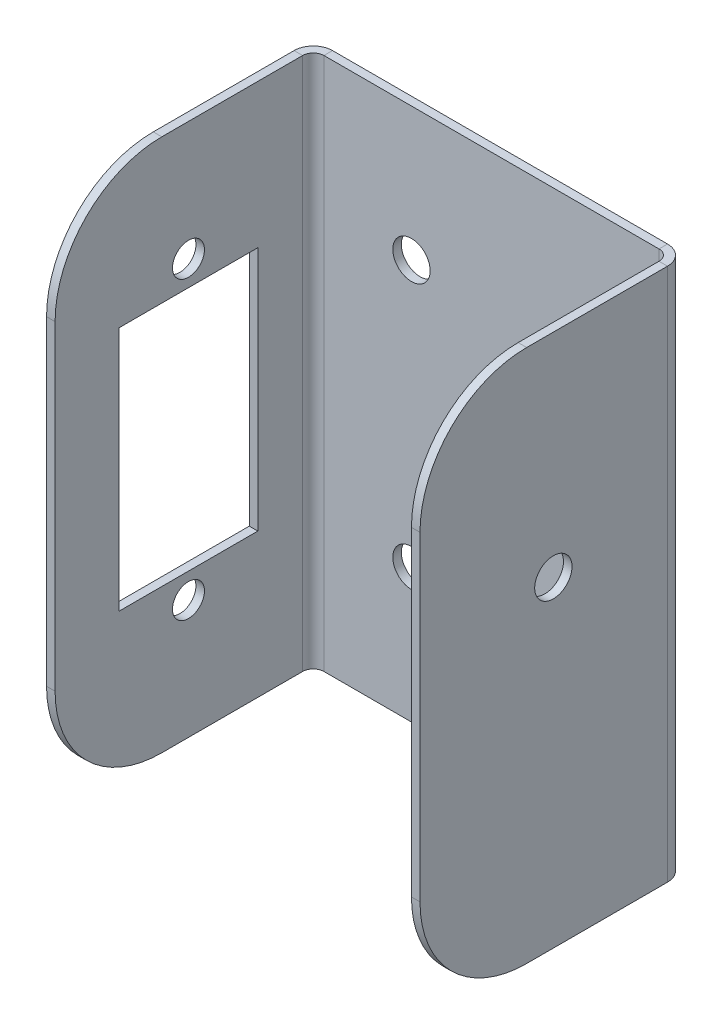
ISO-10303-21;
HEADER;
FILE_DESCRIPTION(('STEP AP214'),'2;1');
FILE_NAME('part.step','',(''),(''),'','','');
FILE_SCHEMA(('AUTOMOTIVE_DESIGN { 1 0 10303 214 1 1 1 1 }'));
ENDSEC;
DATA;
#1=APPLICATION_CONTEXT('core data for automotive mechanical design processes');
#2=APPLICATION_PROTOCOL_DEFINITION('international standard','automotive_design',2000,#1);
#3=PRODUCT_CONTEXT('',#1,'mechanical');
#4=PRODUCT('Part','Part','',(#3));
#5=PRODUCT_RELATED_PRODUCT_CATEGORY('part','',(#4));
#6=PRODUCT_DEFINITION_FORMATION('','',#4);
#7=PRODUCT_DEFINITION_CONTEXT('part definition',#1,'design');
#8=PRODUCT_DEFINITION('design','',#6,#7);
#9=PRODUCT_DEFINITION_SHAPE('','',#8);
#10=(LENGTH_UNIT() NAMED_UNIT(*) SI_UNIT(.MILLI.,.METRE.));
#11=(NAMED_UNIT(*) PLANE_ANGLE_UNIT() SI_UNIT($,.RADIAN.));
#12=(NAMED_UNIT(*) SI_UNIT($,.STERADIAN.) SOLID_ANGLE_UNIT());
#13=UNCERTAINTY_MEASURE_WITH_UNIT(LENGTH_MEASURE(1.E-05),#10,'distance_accuracy_value','');
#14=(GEOMETRIC_REPRESENTATION_CONTEXT(3) GLOBAL_UNCERTAINTY_ASSIGNED_CONTEXT((#13)) GLOBAL_UNIT_ASSIGNED_CONTEXT((#10,
#11,#12)) REPRESENTATION_CONTEXT('',''));
#15=CARTESIAN_POINT('',(0.,0.,0.));
#16=DIRECTION('',(0.,0.,1.));
#17=DIRECTION('',(1.,0.,0.));
#18=AXIS2_PLACEMENT_3D('',#15,#16,#17);
#19=CARTESIAN_POINT('',(-17.5,25.,0.8));
#20=DIRECTION('',(0.,-1.,0.));
#21=DIRECTION('',(0.,0.,-1.));
#22=AXIS2_PLACEMENT_3D('',#19,#20,#21);
#23=PLANE('',#22);
#24=DIRECTION('',(0.,0.,-1.));
#25=VECTOR('',#24,1.);
#26=CARTESIAN_POINT('',(15.7,25.,0.799999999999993));
#27=LINE('',#26,#25);
#28=CARTESIAN_POINT('',(15.7,25.,0.8));
#29=VERTEX_POINT('',#28);
#30=CARTESIAN_POINT('',(15.7,25.,0.));
#31=VERTEX_POINT('',#30);
#32=EDGE_CURVE('E301',#29,#31,#27,.T.);
#33=ORIENTED_EDGE('',*,*,#32,.T.);
#34=DIRECTION('',(-1.,0.,0.));
#35=VECTOR('',#34,1.);
#36=CARTESIAN_POINT('',(-17.5,25.,0.));
#37=LINE('',#36,#35);
#38=CARTESIAN_POINT('',(-15.7,25.,0.));
#39=VERTEX_POINT('',#38);
#40=EDGE_CURVE('E362',#31,#39,#37,.T.);
#41=ORIENTED_EDGE('',*,*,#40,.T.);
#42=DIRECTION('',(0.,0.,-1.));
#43=VECTOR('',#42,1.);
#44=CARTESIAN_POINT('',(-15.7,25.,0.799999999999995));
#45=LINE('',#44,#43);
#46=CARTESIAN_POINT('',(-15.7,25.,0.8));
#47=VERTEX_POINT('',#46);
#48=EDGE_CURVE('E359',#47,#39,#45,.T.);
#49=ORIENTED_EDGE('',*,*,#48,.F.);
#50=DIRECTION('',(-1.,0.,0.));
#51=VECTOR('',#50,1.);
#52=CARTESIAN_POINT('',(-17.5,25.,0.8));
#53=LINE('',#52,#51);
#54=EDGE_CURVE('E364',#29,#47,#53,.T.);
#55=ORIENTED_EDGE('',*,*,#54,.F.);
#56=EDGE_LOOP('',(#33,#41,#49,#55));
#57=FACE_BOUND('',#56,.T.);
#58=ADVANCED_FACE('F80',(#57),#23,.F.);
#59=CARTESIAN_POINT('',(-17.5,-25.,0.8));
#60=DIRECTION('',(0.,1.,0.));
#61=DIRECTION('',(0.,0.,1.));
#62=AXIS2_PLACEMENT_3D('',#59,#60,#61);
#63=PLANE('',#62);
#64=DIRECTION('',(0.,0.,-1.));
#65=VECTOR('',#64,1.);
#66=CARTESIAN_POINT('',(15.7,-25.,0.799999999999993));
#67=LINE('',#66,#65);
#68=CARTESIAN_POINT('',(15.7,-25.,0.8));
#69=VERTEX_POINT('',#68);
#70=CARTESIAN_POINT('',(15.7,-25.,0.));
#71=VERTEX_POINT('',#70);
#72=EDGE_CURVE('E312',#69,#71,#67,.T.);
#73=ORIENTED_EDGE('',*,*,#72,.F.);
#74=DIRECTION('',(1.,0.,0.));
#75=VECTOR('',#74,1.);
#76=CARTESIAN_POINT('',(-17.5,-25.,0.8));
#77=LINE('',#76,#75);
#78=CARTESIAN_POINT('',(-15.7,-25.,0.8));
#79=VERTEX_POINT('',#78);
#80=EDGE_CURVE('E366',#79,#69,#77,.T.);
#81=ORIENTED_EDGE('',*,*,#80,.F.);
#82=DIRECTION('',(0.,0.,-1.));
#83=VECTOR('',#82,1.);
#84=CARTESIAN_POINT('',(-15.7,-25.,0.799999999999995));
#85=LINE('',#84,#83);
#86=CARTESIAN_POINT('',(-15.7,-25.,0.));
#87=VERTEX_POINT('',#86);
#88=EDGE_CURVE('E348',#79,#87,#85,.T.);
#89=ORIENTED_EDGE('',*,*,#88,.T.);
#90=DIRECTION('',(1.,0.,0.));
#91=VECTOR('',#90,1.);
#92=CARTESIAN_POINT('',(-17.5,-25.,0.));
#93=LINE('',#92,#91);
#94=EDGE_CURVE('E367',#87,#71,#93,.T.);
#95=ORIENTED_EDGE('',*,*,#94,.T.);
#96=EDGE_LOOP('',(#73,#81,#89,#95));
#97=FACE_BOUND('',#96,.T.);
#98=ADVANCED_FACE('F440',(#97),#63,.F.);
#99=CARTESIAN_POINT('',(0.,0.,0.8));
#100=DIRECTION('',(0.,0.,1.));
#101=DIRECTION('',(1.,0.,0.));
#102=AXIS2_PLACEMENT_3D('',#99,#100,#101);
#103=PLANE('',#102);
#104=CARTESIAN_POINT('',(7.5,12.5,0.8));
#105=DIRECTION('',(0.,0.,-1.));
#106=DIRECTION('',(-1.,0.,0.));
#107=AXIS2_PLACEMENT_3D('',#104,#105,#106);
#108=CIRCLE('',#107,1.75);
#109=CARTESIAN_POINT('',(5.75,12.5,0.8));
#110=VERTEX_POINT('',#109);
#111=EDGE_CURVE('E892',#110,#110,#108,.T.);
#112=ORIENTED_EDGE('',*,*,#111,.T.);
#113=EDGE_LOOP('',(#112));
#114=FACE_BOUND('',#113,.T.);
#115=CARTESIAN_POINT('',(-7.5,-12.5,0.8));
#116=DIRECTION('',(0.,0.,-1.));
#117=DIRECTION('',(-1.,0.,0.));
#118=AXIS2_PLACEMENT_3D('',#115,#116,#117);
#119=CIRCLE('',#118,1.75);
#120=CARTESIAN_POINT('',(-9.25,-12.5,0.8));
#121=VERTEX_POINT('',#120);
#122=EDGE_CURVE('E913',#121,#121,#119,.T.);
#123=ORIENTED_EDGE('',*,*,#122,.T.);
#124=EDGE_LOOP('',(#123));
#125=FACE_BOUND('',#124,.T.);
#126=CARTESIAN_POINT('',(7.5,-12.5,0.8));
#127=DIRECTION('',(0.,0.,-1.));
#128=DIRECTION('',(-1.,0.,0.));
#129=AXIS2_PLACEMENT_3D('',#126,#127,#128);
#130=CIRCLE('',#129,1.75);
#131=CARTESIAN_POINT('',(5.75,-12.5,0.8));
#132=VERTEX_POINT('',#131);
#133=EDGE_CURVE('E906',#132,#132,#130,.T.);
#134=ORIENTED_EDGE('',*,*,#133,.T.);
#135=EDGE_LOOP('',(#134));
#136=FACE_BOUND('',#135,.T.);
#137=CARTESIAN_POINT('',(-7.5,12.5,0.8));
#138=DIRECTION('',(0.,0.,-1.));
#139=DIRECTION('',(-1.,0.,0.));
#140=AXIS2_PLACEMENT_3D('',#137,#138,#139);
#141=CIRCLE('',#140,1.75);
#142=CARTESIAN_POINT('',(-9.25,12.5,0.8));
#143=VERTEX_POINT('',#142);
#144=EDGE_CURVE('E884',#143,#143,#141,.T.);
#145=ORIENTED_EDGE('',*,*,#144,.T.);
#146=EDGE_LOOP('',(#145));
#147=FACE_BOUND('',#146,.T.);
#148=ORIENTED_EDGE('',*,*,#80,.T.);
#149=DIRECTION('',(0.,1.,0.));
#150=VECTOR('',#149,1.);
#151=CARTESIAN_POINT('',(15.7,25.,0.799999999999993));
#152=LINE('',#151,#150);
#153=EDGE_CURVE('E307',#29,#69,#152,.F.);
#154=ORIENTED_EDGE('',*,*,#153,.F.);
#155=ORIENTED_EDGE('',*,*,#54,.T.);
#156=DIRECTION('',(0.,-1.,0.));
#157=VECTOR('',#156,1.);
#158=CARTESIAN_POINT('',(-15.7,-25.,0.799999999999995));
#159=LINE('',#158,#157);
#160=EDGE_CURVE('E354',#79,#47,#159,.F.);
#161=ORIENTED_EDGE('',*,*,#160,.F.);
#162=EDGE_LOOP('',(#148,#154,#155,#161));
#163=FACE_BOUND('',#162,.T.);
#164=ADVANCED_FACE('F444',(#114,#125,#136,#147,#163),#103,.T.);
#165=CARTESIAN_POINT('',(0.,0.,0.));
#166=DIRECTION('',(0.,0.,1.));
#167=DIRECTION('',(1.,0.,0.));
#168=AXIS2_PLACEMENT_3D('',#165,#166,#167);
#169=PLANE('',#168);
#170=CARTESIAN_POINT('',(7.5,12.5,0.));
#171=DIRECTION('',(0.,0.,-1.));
#172=DIRECTION('',(-1.,0.,0.));
#173=AXIS2_PLACEMENT_3D('',#170,#171,#172);
#174=CIRCLE('',#173,1.75);
#175=CARTESIAN_POINT('',(5.75,12.5,0.));
#176=VERTEX_POINT('',#175);
#177=EDGE_CURVE('E916',#176,#176,#174,.T.);
#178=ORIENTED_EDGE('',*,*,#177,.F.);
#179=EDGE_LOOP('',(#178));
#180=FACE_BOUND('',#179,.T.);
#181=CARTESIAN_POINT('',(-7.5,-12.5,0.));
#182=DIRECTION('',(0.,0.,-1.));
#183=DIRECTION('',(-1.,0.,0.));
#184=AXIS2_PLACEMENT_3D('',#181,#182,#183);
#185=CIRCLE('',#184,1.75);
#186=CARTESIAN_POINT('',(-9.25,-12.5,0.));
#187=VERTEX_POINT('',#186);
#188=EDGE_CURVE('E910',#187,#187,#185,.T.);
#189=ORIENTED_EDGE('',*,*,#188,.F.);
#190=EDGE_LOOP('',(#189));
#191=FACE_BOUND('',#190,.T.);
#192=CARTESIAN_POINT('',(7.5,-12.5,0.));
#193=DIRECTION('',(0.,0.,-1.));
#194=DIRECTION('',(-1.,0.,0.));
#195=AXIS2_PLACEMENT_3D('',#192,#193,#194);
#196=CIRCLE('',#195,1.75);
#197=CARTESIAN_POINT('',(5.75,-12.5,0.));
#198=VERTEX_POINT('',#197);
#199=EDGE_CURVE('E895',#198,#198,#196,.T.);
#200=ORIENTED_EDGE('',*,*,#199,.F.);
#201=EDGE_LOOP('',(#200));
#202=FACE_BOUND('',#201,.T.);
#203=CARTESIAN_POINT('',(-7.5,12.5,0.));
#204=DIRECTION('',(0.,0.,-1.));
#205=DIRECTION('',(-1.,0.,0.));
#206=AXIS2_PLACEMENT_3D('',#203,#204,#205);
#207=CIRCLE('',#206,1.75);
#208=CARTESIAN_POINT('',(-9.25,12.5,0.));
#209=VERTEX_POINT('',#208);
#210=EDGE_CURVE('E887',#209,#209,#207,.T.);
#211=ORIENTED_EDGE('',*,*,#210,.F.);
#212=EDGE_LOOP('',(#211));
#213=FACE_BOUND('',#212,.T.);
#214=DIRECTION('',(0.,1.,0.));
#215=VECTOR('',#214,1.);
#216=CARTESIAN_POINT('',(15.7,25.,0.));
#217=LINE('',#216,#215);
#218=EDGE_CURVE('E295',#31,#71,#217,.F.);
#219=ORIENTED_EDGE('',*,*,#218,.T.);
#220=ORIENTED_EDGE('',*,*,#94,.F.);
#221=DIRECTION('',(0.,-1.,0.));
#222=VECTOR('',#221,1.);
#223=CARTESIAN_POINT('',(-15.7,-25.,0.));
#224=LINE('',#223,#222);
#225=EDGE_CURVE('E341',#87,#39,#224,.F.);
#226=ORIENTED_EDGE('',*,*,#225,.T.);
#227=ORIENTED_EDGE('',*,*,#40,.F.);
#228=EDGE_LOOP('',(#219,#220,#226,#227));
#229=FACE_BOUND('',#228,.T.);
#230=ADVANCED_FACE('F456',(#180,#191,#202,#213,#229),#169,.F.);
#231=CARTESIAN_POINT('',(-15.7,25.,1.8));
#232=DIRECTION('',(0.,1.,0.));
#233=DIRECTION('',(0.,0.,1.));
#234=AXIS2_PLACEMENT_3D('',#231,#232,#233);
#235=PLANE('',#234);
#236=DIRECTION('',(1.,0.,0.));
#237=VECTOR('',#236,1.);
#238=CARTESIAN_POINT('',(-17.5,25.,1.79999999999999));
#239=LINE('',#238,#237);
#240=CARTESIAN_POINT('',(-16.7,25.,1.8));
#241=VERTEX_POINT('',#240);
#242=CARTESIAN_POINT('',(-17.5,25.,1.79999999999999));
#243=VERTEX_POINT('',#242);
#244=EDGE_CURVE('E315',#241,#243,#239,.F.);
#245=ORIENTED_EDGE('',*,*,#244,.F.);
#246=CARTESIAN_POINT('',(-15.7,25.,1.8));
#247=DIRECTION('',(0.,-1.,0.));
#248=DIRECTION('',(0.,0.,-1.));
#249=AXIS2_PLACEMENT_3D('',#246,#247,#248);
#250=CIRCLE('',#249,1.);
#251=EDGE_CURVE('E351',#47,#241,#250,.F.);
#252=ORIENTED_EDGE('',*,*,#251,.F.);
#253=ORIENTED_EDGE('',*,*,#48,.T.);
#254=CARTESIAN_POINT('',(-15.7,25.,1.8));
#255=DIRECTION('',(0.,-1.,0.));
#256=DIRECTION('',(0.,0.,-1.));
#257=AXIS2_PLACEMENT_3D('',#254,#255,#256);
#258=CIRCLE('',#257,1.8);
#259=EDGE_CURVE('E344',#39,#243,#258,.F.);
#260=ORIENTED_EDGE('',*,*,#259,.T.);
#261=EDGE_LOOP('',(#245,#252,#253,#260));
#262=FACE_BOUND('',#261,.T.);
#263=ADVANCED_FACE('F463',(#262),#235,.T.);
#264=CARTESIAN_POINT('',(-15.7,-25.,1.8));
#265=DIRECTION('',(0.,1.,0.));
#266=DIRECTION('',(0.,0.,1.));
#267=AXIS2_PLACEMENT_3D('',#264,#265,#266);
#268=PLANE('',#267);
#269=CARTESIAN_POINT('',(-15.7,-25.,1.8));
#270=DIRECTION('',(0.,-1.,0.));
#271=DIRECTION('',(0.,0.,-1.));
#272=AXIS2_PLACEMENT_3D('',#269,#270,#271);
#273=CIRCLE('',#272,1.);
#274=CARTESIAN_POINT('',(-16.7,-25.,1.8));
#275=VERTEX_POINT('',#274);
#276=EDGE_CURVE('E319',#275,#79,#273,.T.);
#277=ORIENTED_EDGE('',*,*,#276,.F.);
#278=DIRECTION('',(1.,0.,0.));
#279=VECTOR('',#278,1.);
#280=CARTESIAN_POINT('',(-16.7,-25.,1.8));
#281=LINE('',#280,#279);
#282=CARTESIAN_POINT('',(-17.5,-25.,1.79999999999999));
#283=VERTEX_POINT('',#282);
#284=EDGE_CURVE('E334',#275,#283,#281,.F.);
#285=ORIENTED_EDGE('',*,*,#284,.T.);
#286=CARTESIAN_POINT('',(-15.7,-25.,1.8));
#287=DIRECTION('',(0.,-1.,0.));
#288=DIRECTION('',(0.,0.,-1.));
#289=AXIS2_PLACEMENT_3D('',#286,#287,#288);
#290=CIRCLE('',#289,1.8);
#291=EDGE_CURVE('E345',#283,#87,#290,.T.);
#292=ORIENTED_EDGE('',*,*,#291,.T.);
#293=ORIENTED_EDGE('',*,*,#88,.F.);
#294=EDGE_LOOP('',(#277,#285,#292,#293));
#295=FACE_BOUND('',#294,.T.);
#296=ADVANCED_FACE('F489',(#295),#268,.F.);
#297=CARTESIAN_POINT('',(-15.7,-25.,1.8));
#298=DIRECTION('',(0.,-1.,0.));
#299=DIRECTION('',(-1.,0.,0.));
#300=AXIS2_PLACEMENT_3D('',#297,#298,#299);
#301=CYLINDRICAL_SURFACE('',#300,1.8);
#302=ORIENTED_EDGE('',*,*,#225,.F.);
#303=ORIENTED_EDGE('',*,*,#291,.F.);
#304=DIRECTION('',(0.,-1.,0.));
#305=VECTOR('',#304,1.);
#306=CARTESIAN_POINT('',(-17.5,25.,1.79999999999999));
#307=LINE('',#306,#305);
#308=EDGE_CURVE('E331',#283,#243,#307,.F.);
#309=ORIENTED_EDGE('',*,*,#308,.T.);
#310=ORIENTED_EDGE('',*,*,#259,.F.);
#311=EDGE_LOOP('',(#302,#303,#309,#310));
#312=FACE_BOUND('',#311,.T.);
#313=ADVANCED_FACE('F464',(#312),#301,.T.);
#314=CARTESIAN_POINT('',(-15.7,-25.,1.8));
#315=DIRECTION('',(0.,-1.,0.));
#316=DIRECTION('',(-1.,0.,0.));
#317=AXIS2_PLACEMENT_3D('',#314,#315,#316);
#318=CYLINDRICAL_SURFACE('',#317,1.);
#319=ORIENTED_EDGE('',*,*,#160,.T.);
#320=ORIENTED_EDGE('',*,*,#251,.T.);
#321=DIRECTION('',(0.,-1.,0.));
#322=VECTOR('',#321,1.);
#323=CARTESIAN_POINT('',(-16.7,25.,1.8));
#324=LINE('',#323,#322);
#325=EDGE_CURVE('E337',#241,#275,#324,.T.);
#326=ORIENTED_EDGE('',*,*,#325,.T.);
#327=ORIENTED_EDGE('',*,*,#276,.T.);
#328=EDGE_LOOP('',(#319,#320,#326,#327));
#329=FACE_BOUND('',#328,.T.);
#330=ADVANCED_FACE('F488',(#329),#318,.F.);
#331=CARTESIAN_POINT('',(-17.5000000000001,-25.,25.));
#332=DIRECTION('',(0.,1.,0.));
#333=DIRECTION('',(-1.,0.,0.));
#334=AXIS2_PLACEMENT_3D('',#331,#332,#333);
#335=PLANE('',#334);
#336=DIRECTION('',(0.,0.,-1.));
#337=VECTOR('',#336,1.);
#338=CARTESIAN_POINT('',(-16.7000000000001,-25.,25.));
#339=LINE('',#338,#337);
#340=CARTESIAN_POINT('',(-16.7,-25.,15.));
#341=VERTEX_POINT('',#340);
#342=EDGE_CURVE('E329',#275,#341,#339,.F.);
#343=ORIENTED_EDGE('',*,*,#342,.T.);
#344=DIRECTION('',(1.,0.,0.));
#345=VECTOR('',#344,1.);
#346=CARTESIAN_POINT('',(-17.5,-25.,15.));
#347=LINE('',#346,#345);
#348=CARTESIAN_POINT('',(-17.5,-25.,15.));
#349=VERTEX_POINT('',#348);
#350=EDGE_CURVE('E103',#341,#349,#347,.F.);
#351=ORIENTED_EDGE('',*,*,#350,.T.);
#352=DIRECTION('',(0.,0.,1.));
#353=VECTOR('',#352,1.);
#354=CARTESIAN_POINT('',(-17.5,-25.,0.));
#355=LINE('',#354,#353);
#356=EDGE_CURVE('E322',#283,#349,#355,.T.);
#357=ORIENTED_EDGE('',*,*,#356,.F.);
#358=ORIENTED_EDGE('',*,*,#284,.F.);
#359=EDGE_LOOP('',(#343,#351,#357,#358));
#360=FACE_BOUND('',#359,.T.);
#361=ADVANCED_FACE('F469',(#360),#335,.F.);
#362=CARTESIAN_POINT('',(-17.5,25.,0.799999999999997));
#363=DIRECTION('',(0.,-1.,0.));
#364=DIRECTION('',(1.,0.,0.));
#365=AXIS2_PLACEMENT_3D('',#362,#363,#364);
#366=PLANE('',#365);
#367=DIRECTION('',(0.,0.,-1.));
#368=VECTOR('',#367,1.);
#369=CARTESIAN_POINT('',(-17.5,25.,0.));
#370=LINE('',#369,#368);
#371=CARTESIAN_POINT('',(-17.5,25.,15.));
#372=VERTEX_POINT('',#371);
#373=EDGE_CURVE('E317',#372,#243,#370,.T.);
#374=ORIENTED_EDGE('',*,*,#373,.F.);
#375=DIRECTION('',(1.,0.,0.));
#376=VECTOR('',#375,1.);
#377=CARTESIAN_POINT('',(-17.5,25.,15.));
#378=LINE('',#377,#376);
#379=CARTESIAN_POINT('',(-16.7,25.,15.));
#380=VERTEX_POINT('',#379);
#381=EDGE_CURVE('E13',#372,#380,#378,.T.);
#382=ORIENTED_EDGE('',*,*,#381,.T.);
#383=DIRECTION('',(0.,0.,1.));
#384=VECTOR('',#383,1.);
#385=CARTESIAN_POINT('',(-16.7,25.,0.8));
#386=LINE('',#385,#384);
#387=EDGE_CURVE('E324',#380,#241,#386,.F.);
#388=ORIENTED_EDGE('',*,*,#387,.T.);
#389=ORIENTED_EDGE('',*,*,#244,.T.);
#390=EDGE_LOOP('',(#374,#382,#388,#389));
#391=FACE_BOUND('',#390,.T.);
#392=ADVANCED_FACE('F486',(#391),#366,.F.);
#393=CARTESIAN_POINT('',(-17.5,0.,0.));
#394=DIRECTION('',(1.,0.,0.));
#395=DIRECTION('',(0.,0.,-1.));
#396=AXIS2_PLACEMENT_3D('',#393,#394,#395);
#397=PLANE('',#396);
#398=CARTESIAN_POINT('',(-17.5,13.85,12.5));
#399=DIRECTION('',(-1.,0.,0.));
#400=DIRECTION('',(0.,0.,1.));
#401=AXIS2_PLACEMENT_3D('',#398,#399,#400);
#402=CIRCLE('',#401,1.5);
#403=CARTESIAN_POINT('',(-17.5,13.85,14.));
#404=VERTEX_POINT('',#403);
#405=EDGE_CURVE('E885',#404,#404,#402,.T.);
#406=ORIENTED_EDGE('',*,*,#405,.F.);
#407=EDGE_LOOP('',(#406));
#408=FACE_BOUND('',#407,.T.);
#409=CARTESIAN_POINT('',(-17.5,-13.85,12.5));
#410=DIRECTION('',(-1.,0.,0.));
#411=DIRECTION('',(0.,0.,1.));
#412=AXIS2_PLACEMENT_3D('',#409,#410,#411);
#413=CIRCLE('',#412,1.5);
#414=CARTESIAN_POINT('',(-17.5,-13.85,14.));
#415=VERTEX_POINT('',#414);
#416=EDGE_CURVE('E251',#415,#415,#413,.T.);
#417=ORIENTED_EDGE('',*,*,#416,.F.);
#418=EDGE_LOOP('',(#417));
#419=FACE_BOUND('',#418,.T.);
#420=DIRECTION('',(0.,0.,-1.));
#421=VECTOR('',#420,1.);
#422=CARTESIAN_POINT('',(-17.5,11.5,6.));
#423=LINE('',#422,#421);
#424=CARTESIAN_POINT('',(-17.5000000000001,11.5,19.));
#425=VERTEX_POINT('',#424);
#426=CARTESIAN_POINT('',(-17.5,11.5,6.));
#427=VERTEX_POINT('',#426);
#428=EDGE_CURVE('E257',#425,#427,#423,.T.);
#429=ORIENTED_EDGE('',*,*,#428,.F.);
#430=DIRECTION('',(0.,1.,0.));
#431=VECTOR('',#430,1.);
#432=CARTESIAN_POINT('',(-17.5000000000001,11.5,19.));
#433=LINE('',#432,#431);
#434=CARTESIAN_POINT('',(-17.5000000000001,-11.5,19.));
#435=VERTEX_POINT('',#434);
#436=EDGE_CURVE('E227',#435,#425,#433,.T.);
#437=ORIENTED_EDGE('',*,*,#436,.F.);
#438=DIRECTION('',(0.,0.,1.));
#439=VECTOR('',#438,1.);
#440=CARTESIAN_POINT('',(-17.5,-11.5,6.));
#441=LINE('',#440,#439);
#442=CARTESIAN_POINT('',(-17.5,-11.5,6.));
#443=VERTEX_POINT('',#442);
#444=EDGE_CURVE('E245',#443,#435,#441,.T.);
#445=ORIENTED_EDGE('',*,*,#444,.F.);
#446=DIRECTION('',(0.,-1.,0.));
#447=VECTOR('',#446,1.);
#448=CARTESIAN_POINT('',(-17.5,11.5,6.));
#449=LINE('',#448,#447);
#450=EDGE_CURVE('E248',#427,#443,#449,.T.);
#451=ORIENTED_EDGE('',*,*,#450,.F.);
#452=EDGE_LOOP('',(#429,#437,#445,#451));
#453=FACE_BOUND('',#452,.T.);
#454=ORIENTED_EDGE('',*,*,#356,.T.);
#455=CARTESIAN_POINT('',(-17.5,-15.,15.));
#456=DIRECTION('',(1.,0.,0.));
#457=DIRECTION('',(0.,0.,-1.));
#458=AXIS2_PLACEMENT_3D('',#455,#456,#457);
#459=CIRCLE('',#458,10.);
#460=CARTESIAN_POINT('',(-17.5000000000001,-15.,25.));
#461=VERTEX_POINT('',#460);
#462=EDGE_CURVE('E400',#349,#461,#459,.F.);
#463=ORIENTED_EDGE('',*,*,#462,.T.);
#464=DIRECTION('',(0.,1.,0.));
#465=VECTOR('',#464,1.);
#466=CARTESIAN_POINT('',(-17.5000000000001,0.,25.));
#467=LINE('',#466,#465);
#468=CARTESIAN_POINT('',(-17.5000000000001,15.,25.));
#469=VERTEX_POINT('',#468);
#470=EDGE_CURVE('E320',#461,#469,#467,.T.);
#471=ORIENTED_EDGE('',*,*,#470,.T.);
#472=CARTESIAN_POINT('',(-17.5,15.,15.));
#473=DIRECTION('',(1.,0.,0.));
#474=DIRECTION('',(0.,0.,-1.));
#475=AXIS2_PLACEMENT_3D('',#472,#473,#474);
#476=CIRCLE('',#475,10.);
#477=EDGE_CURVE('E95',#469,#372,#476,.F.);
#478=ORIENTED_EDGE('',*,*,#477,.T.);
#479=ORIENTED_EDGE('',*,*,#373,.T.);
#480=ORIENTED_EDGE('',*,*,#308,.F.);
#481=EDGE_LOOP('',(#454,#463,#471,#478,#479,#480));
#482=FACE_BOUND('',#481,.T.);
#483=ADVANCED_FACE('F466',(#408,#419,#453,#482),#397,.F.);
#484=CARTESIAN_POINT('',(-16.7,0.,0.));
#485=DIRECTION('',(1.,0.,0.));
#486=DIRECTION('',(0.,0.,-1.));
#487=AXIS2_PLACEMENT_3D('',#484,#485,#486);
#488=PLANE('',#487);
#489=CARTESIAN_POINT('',(-16.7,13.85,12.5));
#490=DIRECTION('',(-1.,0.,0.));
#491=DIRECTION('',(0.,0.,1.));
#492=AXIS2_PLACEMENT_3D('',#489,#490,#491);
#493=CIRCLE('',#492,1.5);
#494=CARTESIAN_POINT('',(-16.7,13.85,14.));
#495=VERTEX_POINT('',#494);
#496=EDGE_CURVE('E258',#495,#495,#493,.T.);
#497=ORIENTED_EDGE('',*,*,#496,.T.);
#498=EDGE_LOOP('',(#497));
#499=FACE_BOUND('',#498,.T.);
#500=CARTESIAN_POINT('',(-16.7,-13.85,12.5));
#501=DIRECTION('',(-1.,0.,0.));
#502=DIRECTION('',(0.,0.,1.));
#503=AXIS2_PLACEMENT_3D('',#500,#501,#502);
#504=CIRCLE('',#503,1.5);
#505=CARTESIAN_POINT('',(-16.7,-13.85,14.));
#506=VERTEX_POINT('',#505);
#507=EDGE_CURVE('E880',#506,#506,#504,.T.);
#508=ORIENTED_EDGE('',*,*,#507,.T.);
#509=EDGE_LOOP('',(#508));
#510=FACE_BOUND('',#509,.T.);
#511=DIRECTION('',(0.,1.,0.));
#512=VECTOR('',#511,1.);
#513=CARTESIAN_POINT('',(-16.7000000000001,11.5,19.));
#514=LINE('',#513,#512);
#515=CARTESIAN_POINT('',(-16.7000000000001,-11.5,19.));
#516=VERTEX_POINT('',#515);
#517=CARTESIAN_POINT('',(-16.7000000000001,11.5,19.));
#518=VERTEX_POINT('',#517);
#519=EDGE_CURVE('E224',#516,#518,#514,.T.);
#520=ORIENTED_EDGE('',*,*,#519,.T.);
#521=DIRECTION('',(0.,0.,-1.));
#522=VECTOR('',#521,1.);
#523=CARTESIAN_POINT('',(-16.7,11.5,6.));
#524=LINE('',#523,#522);
#525=CARTESIAN_POINT('',(-16.7,11.5,6.));
#526=VERTEX_POINT('',#525);
#527=EDGE_CURVE('E236',#518,#526,#524,.T.);
#528=ORIENTED_EDGE('',*,*,#527,.T.);
#529=DIRECTION('',(0.,-1.,0.));
#530=VECTOR('',#529,1.);
#531=CARTESIAN_POINT('',(-16.7,11.5,6.));
#532=LINE('',#531,#530);
#533=CARTESIAN_POINT('',(-16.7,-11.5,6.));
#534=VERTEX_POINT('',#533);
#535=EDGE_CURVE('E240',#526,#534,#532,.T.);
#536=ORIENTED_EDGE('',*,*,#535,.T.);
#537=DIRECTION('',(0.,0.,1.));
#538=VECTOR('',#537,1.);
#539=CARTESIAN_POINT('',(-16.7,-11.5,6.));
#540=LINE('',#539,#538);
#541=EDGE_CURVE('E232',#534,#516,#540,.T.);
#542=ORIENTED_EDGE('',*,*,#541,.T.);
#543=EDGE_LOOP('',(#520,#528,#536,#542));
#544=FACE_BOUND('',#543,.T.);
#545=DIRECTION('',(0.,-1.,0.));
#546=VECTOR('',#545,1.);
#547=CARTESIAN_POINT('',(-16.7000000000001,25.,25.));
#548=LINE('',#547,#546);
#549=CARTESIAN_POINT('',(-16.7000000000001,-15.,25.));
#550=VERTEX_POINT('',#549);
#551=CARTESIAN_POINT('',(-16.7000000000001,15.,25.));
#552=VERTEX_POINT('',#551);
#553=EDGE_CURVE('E326',#550,#552,#548,.F.);
#554=ORIENTED_EDGE('',*,*,#553,.F.);
#555=CARTESIAN_POINT('',(-16.7,-15.,15.));
#556=DIRECTION('',(1.,0.,0.));
#557=DIRECTION('',(0.,0.,-1.));
#558=AXIS2_PLACEMENT_3D('',#555,#556,#557);
#559=CIRCLE('',#558,10.);
#560=EDGE_CURVE('E396',#550,#341,#559,.T.);
#561=ORIENTED_EDGE('',*,*,#560,.T.);
#562=ORIENTED_EDGE('',*,*,#342,.F.);
#563=ORIENTED_EDGE('',*,*,#325,.F.);
#564=ORIENTED_EDGE('',*,*,#387,.F.);
#565=CARTESIAN_POINT('',(-16.7,15.,15.));
#566=DIRECTION('',(1.,0.,0.));
#567=DIRECTION('',(0.,0.,-1.));
#568=AXIS2_PLACEMENT_3D('',#565,#566,#567);
#569=CIRCLE('',#568,10.);
#570=EDGE_CURVE('E394',#380,#552,#569,.T.);
#571=ORIENTED_EDGE('',*,*,#570,.T.);
#572=EDGE_LOOP('',(#554,#561,#562,#563,#564,#571));
#573=FACE_BOUND('',#572,.T.);
#574=ADVANCED_FACE('F242',(#499,#510,#544,#573),#488,.T.);
#575=CARTESIAN_POINT('',(-17.5000000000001,25.,25.));
#576=DIRECTION('',(0.,0.,-1.));
#577=DIRECTION('',(-1.,0.,0.));
#578=AXIS2_PLACEMENT_3D('',#575,#576,#577);
#579=PLANE('',#578);
#580=ORIENTED_EDGE('',*,*,#470,.F.);
#581=DIRECTION('',(1.,0.,0.));
#582=VECTOR('',#581,1.);
#583=CARTESIAN_POINT('',(-17.5000000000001,-15.,25.));
#584=LINE('',#583,#582);
#585=EDGE_CURVE('E391',#461,#550,#584,.T.);
#586=ORIENTED_EDGE('',*,*,#585,.T.);
#587=ORIENTED_EDGE('',*,*,#553,.T.);
#588=DIRECTION('',(1.,0.,0.));
#589=VECTOR('',#588,1.);
#590=CARTESIAN_POINT('',(-17.5000000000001,15.,25.));
#591=LINE('',#590,#589);
#592=EDGE_CURVE('E389',#552,#469,#591,.F.);
#593=ORIENTED_EDGE('',*,*,#592,.T.);
#594=EDGE_LOOP('',(#580,#586,#587,#593));
#595=FACE_BOUND('',#594,.T.);
#596=ADVANCED_FACE('F481',(#595),#579,.F.);
#597=CARTESIAN_POINT('',(15.7,-25.,1.8));
#598=DIRECTION('',(0.,-1.,0.));
#599=DIRECTION('',(0.,0.,-1.));
#600=AXIS2_PLACEMENT_3D('',#597,#598,#599);
#601=PLANE('',#600);
#602=DIRECTION('',(-1.,0.,0.));
#603=VECTOR('',#602,1.);
#604=CARTESIAN_POINT('',(17.5,-25.,1.79999999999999));
#605=LINE('',#604,#603);
#606=CARTESIAN_POINT('',(16.7,-25.,1.79999999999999));
#607=VERTEX_POINT('',#606);
#608=CARTESIAN_POINT('',(17.5,-25.,1.79999999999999));
#609=VERTEX_POINT('',#608);
#610=EDGE_CURVE('E264',#607,#609,#605,.F.);
#611=ORIENTED_EDGE('',*,*,#610,.F.);
#612=CARTESIAN_POINT('',(15.7,-25.,1.8));
#613=DIRECTION('',(0.,1.,0.));
#614=DIRECTION('',(0.,0.,1.));
#615=AXIS2_PLACEMENT_3D('',#612,#613,#614);
#616=CIRCLE('',#615,1.);
#617=EDGE_CURVE('E304',#69,#607,#616,.F.);
#618=ORIENTED_EDGE('',*,*,#617,.F.);
#619=ORIENTED_EDGE('',*,*,#72,.T.);
#620=CARTESIAN_POINT('',(15.7,-25.,1.8));
#621=DIRECTION('',(0.,1.,0.));
#622=DIRECTION('',(0.,0.,1.));
#623=AXIS2_PLACEMENT_3D('',#620,#621,#622);
#624=CIRCLE('',#623,1.8);
#625=EDGE_CURVE('E297',#71,#609,#624,.F.);
#626=ORIENTED_EDGE('',*,*,#625,.T.);
#627=EDGE_LOOP('',(#611,#618,#619,#626));
#628=FACE_BOUND('',#627,.T.);
#629=ADVANCED_FACE('F436',(#628),#601,.T.);
#630=CARTESIAN_POINT('',(15.7,25.,1.8));
#631=DIRECTION('',(0.,-1.,0.));
#632=DIRECTION('',(0.,0.,-1.));
#633=AXIS2_PLACEMENT_3D('',#630,#631,#632);
#634=PLANE('',#633);
#635=CARTESIAN_POINT('',(15.7,25.,1.8));
#636=DIRECTION('',(0.,1.,0.));
#637=DIRECTION('',(0.,0.,1.));
#638=AXIS2_PLACEMENT_3D('',#635,#636,#637);
#639=CIRCLE('',#638,1.);
#640=CARTESIAN_POINT('',(16.7,25.,1.79999999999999));
#641=VERTEX_POINT('',#640);
#642=EDGE_CURVE('E271',#641,#29,#639,.T.);
#643=ORIENTED_EDGE('',*,*,#642,.F.);
#644=DIRECTION('',(-1.,0.,0.));
#645=VECTOR('',#644,1.);
#646=CARTESIAN_POINT('',(16.7,25.,1.79999999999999));
#647=LINE('',#646,#645);
#648=CARTESIAN_POINT('',(17.5,25.,1.79999999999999));
#649=VERTEX_POINT('',#648);
#650=EDGE_CURVE('E288',#641,#649,#647,.F.);
#651=ORIENTED_EDGE('',*,*,#650,.T.);
#652=CARTESIAN_POINT('',(15.7,25.,1.8));
#653=DIRECTION('',(0.,1.,0.));
#654=DIRECTION('',(0.,0.,1.));
#655=AXIS2_PLACEMENT_3D('',#652,#653,#654);
#656=CIRCLE('',#655,1.8);
#657=EDGE_CURVE('E298',#649,#31,#656,.T.);
#658=ORIENTED_EDGE('',*,*,#657,.T.);
#659=ORIENTED_EDGE('',*,*,#32,.F.);
#660=EDGE_LOOP('',(#643,#651,#658,#659));
#661=FACE_BOUND('',#660,.T.);
#662=ADVANCED_FACE('F451',(#661),#634,.F.);
#663=CARTESIAN_POINT('',(15.7,25.,1.8));
#664=DIRECTION('',(0.,1.,0.));
#665=DIRECTION('',(1.,0.,0.));
#666=AXIS2_PLACEMENT_3D('',#663,#664,#665);
#667=CYLINDRICAL_SURFACE('',#666,1.8);
#668=ORIENTED_EDGE('',*,*,#218,.F.);
#669=ORIENTED_EDGE('',*,*,#657,.F.);
#670=DIRECTION('',(0.,1.,0.));
#671=VECTOR('',#670,1.);
#672=CARTESIAN_POINT('',(17.5,-25.,1.79999999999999));
#673=LINE('',#672,#671);
#674=EDGE_CURVE('E285',#649,#609,#673,.F.);
#675=ORIENTED_EDGE('',*,*,#674,.T.);
#676=ORIENTED_EDGE('',*,*,#625,.F.);
#677=EDGE_LOOP('',(#668,#669,#675,#676));
#678=FACE_BOUND('',#677,.T.);
#679=ADVANCED_FACE('F434',(#678),#667,.T.);
#680=CARTESIAN_POINT('',(15.7,25.,1.8));
#681=DIRECTION('',(0.,1.,0.));
#682=DIRECTION('',(1.,0.,0.));
#683=AXIS2_PLACEMENT_3D('',#680,#681,#682);
#684=CYLINDRICAL_SURFACE('',#683,1.);
#685=ORIENTED_EDGE('',*,*,#153,.T.);
#686=ORIENTED_EDGE('',*,*,#617,.T.);
#687=DIRECTION('',(0.,1.,0.));
#688=VECTOR('',#687,1.);
#689=CARTESIAN_POINT('',(16.7,-25.,1.8));
#690=LINE('',#689,#688);
#691=EDGE_CURVE('E291',#607,#641,#690,.T.);
#692=ORIENTED_EDGE('',*,*,#691,.T.);
#693=ORIENTED_EDGE('',*,*,#642,.T.);
#694=EDGE_LOOP('',(#685,#686,#692,#693));
#695=FACE_BOUND('',#694,.T.);
#696=ADVANCED_FACE('F447',(#695),#684,.F.);
#697=CARTESIAN_POINT('',(17.5,-25.,0.799999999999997));
#698=DIRECTION('',(0.,1.,0.));
#699=DIRECTION('',(-1.,0.,0.));
#700=AXIS2_PLACEMENT_3D('',#697,#698,#699);
#701=PLANE('',#700);
#702=DIRECTION('',(0.,0.,-1.));
#703=VECTOR('',#702,1.);
#704=CARTESIAN_POINT('',(17.5,-25.,0.));
#705=LINE('',#704,#703);
#706=CARTESIAN_POINT('',(17.5000000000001,-25.,15.));
#707=VERTEX_POINT('',#706);
#708=EDGE_CURVE('E275',#707,#609,#705,.T.);
#709=ORIENTED_EDGE('',*,*,#708,.F.);
#710=DIRECTION('',(-1.,0.,0.));
#711=VECTOR('',#710,1.);
#712=CARTESIAN_POINT('',(17.5000000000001,-25.,15.));
#713=LINE('',#712,#711);
#714=CARTESIAN_POINT('',(16.7000000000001,-25.,15.));
#715=VERTEX_POINT('',#714);
#716=EDGE_CURVE('E370',#707,#715,#713,.T.);
#717=ORIENTED_EDGE('',*,*,#716,.T.);
#718=DIRECTION('',(0.,0.,1.));
#719=VECTOR('',#718,1.);
#720=CARTESIAN_POINT('',(16.7,-25.,0.8));
#721=LINE('',#720,#719);
#722=EDGE_CURVE('E283',#715,#607,#721,.F.);
#723=ORIENTED_EDGE('',*,*,#722,.T.);
#724=ORIENTED_EDGE('',*,*,#610,.T.);
#725=EDGE_LOOP('',(#709,#717,#723,#724));
#726=FACE_BOUND('',#725,.T.);
#727=ADVANCED_FACE('F429',(#726),#701,.F.);
#728=CARTESIAN_POINT('',(17.5000000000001,25.,25.));
#729=DIRECTION('',(0.,-1.,0.));
#730=DIRECTION('',(1.,0.,0.));
#731=AXIS2_PLACEMENT_3D('',#728,#729,#730);
#732=PLANE('',#731);
#733=DIRECTION('',(0.,0.,-1.));
#734=VECTOR('',#733,1.);
#735=CARTESIAN_POINT('',(16.7000000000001,25.,25.));
#736=LINE('',#735,#734);
#737=CARTESIAN_POINT('',(16.7000000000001,25.,15.));
#738=VERTEX_POINT('',#737);
#739=EDGE_CURVE('E280',#641,#738,#736,.F.);
#740=ORIENTED_EDGE('',*,*,#739,.T.);
#741=DIRECTION('',(-1.,0.,0.));
#742=VECTOR('',#741,1.);
#743=CARTESIAN_POINT('',(17.5000000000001,25.,15.));
#744=LINE('',#743,#742);
#745=CARTESIAN_POINT('',(17.5000000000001,25.,15.));
#746=VERTEX_POINT('',#745);
#747=EDGE_CURVE('E88',#738,#746,#744,.F.);
#748=ORIENTED_EDGE('',*,*,#747,.T.);
#749=DIRECTION('',(0.,0.,1.));
#750=VECTOR('',#749,1.);
#751=CARTESIAN_POINT('',(17.5,25.,0.));
#752=LINE('',#751,#750);
#753=EDGE_CURVE('E272',#649,#746,#752,.T.);
#754=ORIENTED_EDGE('',*,*,#753,.F.);
#755=ORIENTED_EDGE('',*,*,#650,.F.);
#756=EDGE_LOOP('',(#740,#748,#754,#755));
#757=FACE_BOUND('',#756,.T.);
#758=ADVANCED_FACE('F404',(#757),#732,.F.);
#759=CARTESIAN_POINT('',(17.5,0.,0.));
#760=DIRECTION('',(-1.,0.,0.));
#761=DIRECTION('',(0.,0.,1.));
#762=AXIS2_PLACEMENT_3D('',#759,#760,#761);
#763=PLANE('',#762);
#764=CARTESIAN_POINT('',(17.5,5.1,12.5));
#765=DIRECTION('',(1.,0.,0.));
#766=DIRECTION('',(0.,0.,-1.));
#767=AXIS2_PLACEMENT_3D('',#764,#765,#766);
#768=CIRCLE('',#767,1.75);
#769=CARTESIAN_POINT('',(17.5,5.1,10.75));
#770=VERTEX_POINT('',#769);
#771=EDGE_CURVE('E921',#770,#770,#768,.T.);
#772=ORIENTED_EDGE('',*,*,#771,.F.);
#773=EDGE_LOOP('',(#772));
#774=FACE_BOUND('',#773,.T.);
#775=DIRECTION('',(0.,-1.,0.));
#776=VECTOR('',#775,1.);
#777=CARTESIAN_POINT('',(17.5000000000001,0.,25.));
#778=LINE('',#777,#776);
#779=CARTESIAN_POINT('',(17.5000000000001,15.,25.));
#780=VERTEX_POINT('',#779);
#781=CARTESIAN_POINT('',(17.5000000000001,-15.,25.));
#782=VERTEX_POINT('',#781);
#783=EDGE_CURVE('E268',#780,#782,#778,.T.);
#784=ORIENTED_EDGE('',*,*,#783,.T.);
#785=CARTESIAN_POINT('',(17.5000000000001,-15.,15.));
#786=DIRECTION('',(-1.,0.,0.));
#787=DIRECTION('',(0.,0.,1.));
#788=AXIS2_PLACEMENT_3D('',#785,#786,#787);
#789=CIRCLE('',#788,10.);
#790=EDGE_CURVE('E387',#782,#707,#789,.F.);
#791=ORIENTED_EDGE('',*,*,#790,.T.);
#792=ORIENTED_EDGE('',*,*,#708,.T.);
#793=ORIENTED_EDGE('',*,*,#674,.F.);
#794=ORIENTED_EDGE('',*,*,#753,.T.);
#795=CARTESIAN_POINT('',(17.5000000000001,15.,15.));
#796=DIRECTION('',(-1.,0.,0.));
#797=DIRECTION('',(0.,0.,1.));
#798=AXIS2_PLACEMENT_3D('',#795,#796,#797);
#799=CIRCLE('',#798,10.);
#800=EDGE_CURVE('E385',#746,#780,#799,.F.);
#801=ORIENTED_EDGE('',*,*,#800,.T.);
#802=EDGE_LOOP('',(#784,#791,#792,#793,#794,#801));
#803=FACE_BOUND('',#802,.T.);
#804=ADVANCED_FACE('F411',(#774,#803),#763,.F.);
#805=CARTESIAN_POINT('',(16.7,0.,0.));
#806=DIRECTION('',(-1.,0.,0.));
#807=DIRECTION('',(0.,0.,1.));
#808=AXIS2_PLACEMENT_3D('',#805,#806,#807);
#809=PLANE('',#808);
#810=CARTESIAN_POINT('',(16.7,5.1,12.5));
#811=DIRECTION('',(1.,0.,0.));
#812=DIRECTION('',(0.,0.,-1.));
#813=AXIS2_PLACEMENT_3D('',#810,#811,#812);
#814=CIRCLE('',#813,1.75);
#815=CARTESIAN_POINT('',(16.7,5.1,10.75));
#816=VERTEX_POINT('',#815);
#817=EDGE_CURVE('E907',#816,#816,#814,.T.);
#818=ORIENTED_EDGE('',*,*,#817,.T.);
#819=EDGE_LOOP('',(#818));
#820=FACE_BOUND('',#819,.T.);
#821=ORIENTED_EDGE('',*,*,#722,.F.);
#822=CARTESIAN_POINT('',(16.7000000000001,-15.,15.));
#823=DIRECTION('',(-1.,0.,0.));
#824=DIRECTION('',(0.,0.,1.));
#825=AXIS2_PLACEMENT_3D('',#822,#823,#824);
#826=CIRCLE('',#825,10.);
#827=CARTESIAN_POINT('',(16.7000000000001,-15.,25.));
#828=VERTEX_POINT('',#827);
#829=EDGE_CURVE('E378',#715,#828,#826,.T.);
#830=ORIENTED_EDGE('',*,*,#829,.T.);
#831=DIRECTION('',(0.,1.,0.));
#832=VECTOR('',#831,1.);
#833=CARTESIAN_POINT('',(16.7000000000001,-25.,25.));
#834=LINE('',#833,#832);
#835=CARTESIAN_POINT('',(16.7000000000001,15.,25.));
#836=VERTEX_POINT('',#835);
#837=EDGE_CURVE('E277',#836,#828,#834,.F.);
#838=ORIENTED_EDGE('',*,*,#837,.F.);
#839=CARTESIAN_POINT('',(16.7000000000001,15.,15.));
#840=DIRECTION('',(-1.,0.,0.));
#841=DIRECTION('',(0.,0.,1.));
#842=AXIS2_PLACEMENT_3D('',#839,#840,#841);
#843=CIRCLE('',#842,10.);
#844=EDGE_CURVE('E376',#836,#738,#843,.T.);
#845=ORIENTED_EDGE('',*,*,#844,.T.);
#846=ORIENTED_EDGE('',*,*,#739,.F.);
#847=ORIENTED_EDGE('',*,*,#691,.F.);
#848=EDGE_LOOP('',(#821,#830,#838,#845,#846,#847));
#849=FACE_BOUND('',#848,.T.);
#850=ADVANCED_FACE('F421',(#820,#849),#809,.T.);
#851=CARTESIAN_POINT('',(17.5000000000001,-25.,25.));
#852=DIRECTION('',(0.,0.,-1.));
#853=DIRECTION('',(-1.,0.,0.));
#854=AXIS2_PLACEMENT_3D('',#851,#852,#853);
#855=PLANE('',#854);
#856=ORIENTED_EDGE('',*,*,#837,.T.);
#857=DIRECTION('',(-1.,0.,0.));
#858=VECTOR('',#857,1.);
#859=CARTESIAN_POINT('',(17.5000000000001,-15.,25.));
#860=LINE('',#859,#858);
#861=EDGE_CURVE('E383',#828,#782,#860,.F.);
#862=ORIENTED_EDGE('',*,*,#861,.T.);
#863=ORIENTED_EDGE('',*,*,#783,.F.);
#864=DIRECTION('',(-1.,0.,0.));
#865=VECTOR('',#864,1.);
#866=CARTESIAN_POINT('',(17.5000000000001,15.,25.));
#867=LINE('',#866,#865);
#868=EDGE_CURVE('E380',#780,#836,#867,.T.);
#869=ORIENTED_EDGE('',*,*,#868,.T.);
#870=EDGE_LOOP('',(#856,#862,#863,#869));
#871=FACE_BOUND('',#870,.T.);
#872=ADVANCED_FACE('F417',(#871),#855,.F.);
#873=CARTESIAN_POINT('',(-16.7000000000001,11.5,19.));
#874=DIRECTION('',(0.,0.,1.));
#875=DIRECTION('',(1.,0.,0.));
#876=AXIS2_PLACEMENT_3D('',#873,#874,#875);
#877=PLANE('',#876);
#878=ORIENTED_EDGE('',*,*,#436,.T.);
#879=DIRECTION('',(-1.,0.,0.));
#880=VECTOR('',#879,1.);
#881=CARTESIAN_POINT('',(-16.7000000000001,11.5,19.));
#882=LINE('',#881,#880);
#883=EDGE_CURVE('E220',#518,#425,#882,.T.);
#884=ORIENTED_EDGE('',*,*,#883,.F.);
#885=ORIENTED_EDGE('',*,*,#519,.F.);
#886=DIRECTION('',(-1.,0.,0.));
#887=VECTOR('',#886,1.);
#888=CARTESIAN_POINT('',(-16.7000000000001,-11.5,19.));
#889=LINE('',#888,#887);
#890=EDGE_CURVE('E262',#516,#435,#889,.T.);
#891=ORIENTED_EDGE('',*,*,#890,.T.);
#892=EDGE_LOOP('',(#878,#884,#885,#891));
#893=FACE_BOUND('',#892,.T.);
#894=ADVANCED_FACE('F222',(#893),#877,.F.);
#895=CARTESIAN_POINT('',(-16.7,-11.5,6.));
#896=DIRECTION('',(0.,-1.,0.));
#897=DIRECTION('',(1.,0.,0.));
#898=AXIS2_PLACEMENT_3D('',#895,#896,#897);
#899=PLANE('',#898);
#900=ORIENTED_EDGE('',*,*,#444,.T.);
#901=ORIENTED_EDGE('',*,*,#890,.F.);
#902=ORIENTED_EDGE('',*,*,#541,.F.);
#903=DIRECTION('',(-1.,0.,0.));
#904=VECTOR('',#903,1.);
#905=CARTESIAN_POINT('',(-16.7,-11.5,6.));
#906=LINE('',#905,#904);
#907=EDGE_CURVE('E265',#534,#443,#906,.T.);
#908=ORIENTED_EDGE('',*,*,#907,.T.);
#909=EDGE_LOOP('',(#900,#901,#902,#908));
#910=FACE_BOUND('',#909,.T.);
#911=ADVANCED_FACE('F749',(#910),#899,.F.);
#912=CARTESIAN_POINT('',(-16.7,11.5,6.));
#913=DIRECTION('',(0.,0.,-1.));
#914=DIRECTION('',(-1.,0.,0.));
#915=AXIS2_PLACEMENT_3D('',#912,#913,#914);
#916=PLANE('',#915);
#917=ORIENTED_EDGE('',*,*,#450,.T.);
#918=ORIENTED_EDGE('',*,*,#907,.F.);
#919=ORIENTED_EDGE('',*,*,#535,.F.);
#920=DIRECTION('',(-1.,0.,0.));
#921=VECTOR('',#920,1.);
#922=CARTESIAN_POINT('',(-16.7,11.5,6.));
#923=LINE('',#922,#921);
#924=EDGE_CURVE('E231',#526,#427,#923,.T.);
#925=ORIENTED_EDGE('',*,*,#924,.T.);
#926=EDGE_LOOP('',(#917,#918,#919,#925));
#927=FACE_BOUND('',#926,.T.);
#928=ADVANCED_FACE('F739',(#927),#916,.F.);
#929=CARTESIAN_POINT('',(-16.7,11.5,6.));
#930=DIRECTION('',(0.,1.,0.));
#931=DIRECTION('',(-1.,0.,0.));
#932=AXIS2_PLACEMENT_3D('',#929,#930,#931);
#933=PLANE('',#932);
#934=ORIENTED_EDGE('',*,*,#428,.T.);
#935=ORIENTED_EDGE('',*,*,#924,.F.);
#936=ORIENTED_EDGE('',*,*,#527,.F.);
#937=ORIENTED_EDGE('',*,*,#883,.T.);
#938=EDGE_LOOP('',(#934,#935,#936,#937));
#939=FACE_BOUND('',#938,.T.);
#940=ADVANCED_FACE('F237',(#939),#933,.F.);
#941=CARTESIAN_POINT('',(-16.7,-13.85,12.5));
#942=DIRECTION('',(-1.,0.,0.));
#943=DIRECTION('',(0.,0.,1.));
#944=AXIS2_PLACEMENT_3D('',#941,#942,#943);
#945=CYLINDRICAL_SURFACE('',#944,1.5);
#946=ORIENTED_EDGE('',*,*,#507,.F.);
#947=EDGE_LOOP('',(#946));
#948=FACE_BOUND('',#947,.T.);
#949=ORIENTED_EDGE('',*,*,#416,.T.);
#950=EDGE_LOOP('',(#949));
#951=FACE_BOUND('',#950,.T.);
#952=ADVANCED_FACE('F718',(#948,#951),#945,.F.);
#953=CARTESIAN_POINT('',(-16.7,13.85,12.5));
#954=DIRECTION('',(-1.,0.,0.));
#955=DIRECTION('',(0.,0.,1.));
#956=AXIS2_PLACEMENT_3D('',#953,#954,#955);
#957=CYLINDRICAL_SURFACE('',#956,1.5);
#958=ORIENTED_EDGE('',*,*,#496,.F.);
#959=EDGE_LOOP('',(#958));
#960=FACE_BOUND('',#959,.T.);
#961=ORIENTED_EDGE('',*,*,#405,.T.);
#962=EDGE_LOOP('',(#961));
#963=FACE_BOUND('',#962,.T.);
#964=ADVANCED_FACE('F688',(#960,#963),#957,.F.);
#965=CARTESIAN_POINT('',(-7.5,12.5,0.8));
#966=DIRECTION('',(0.,0.,-1.));
#967=DIRECTION('',(-1.,0.,0.));
#968=AXIS2_PLACEMENT_3D('',#965,#966,#967);
#969=CYLINDRICAL_SURFACE('',#968,1.75);
#970=ORIENTED_EDGE('',*,*,#144,.F.);
#971=EDGE_LOOP('',(#970));
#972=FACE_BOUND('',#971,.T.);
#973=ORIENTED_EDGE('',*,*,#210,.T.);
#974=EDGE_LOOP('',(#973));
#975=FACE_BOUND('',#974,.T.);
#976=ADVANCED_FACE('F677',(#972,#975),#969,.F.);
#977=CARTESIAN_POINT('',(7.5,-12.5,0.8));
#978=DIRECTION('',(0.,0.,-1.));
#979=DIRECTION('',(-1.,0.,0.));
#980=AXIS2_PLACEMENT_3D('',#977,#978,#979);
#981=CYLINDRICAL_SURFACE('',#980,1.75);
#982=ORIENTED_EDGE('',*,*,#133,.F.);
#983=EDGE_LOOP('',(#982));
#984=FACE_BOUND('',#983,.T.);
#985=ORIENTED_EDGE('',*,*,#199,.T.);
#986=EDGE_LOOP('',(#985));
#987=FACE_BOUND('',#986,.T.);
#988=ADVANCED_FACE('F666',(#984,#987),#981,.F.);
#989=CARTESIAN_POINT('',(-7.5,-12.5,0.8));
#990=DIRECTION('',(0.,0.,-1.));
#991=DIRECTION('',(-1.,0.,0.));
#992=AXIS2_PLACEMENT_3D('',#989,#990,#991);
#993=CYLINDRICAL_SURFACE('',#992,1.75);
#994=ORIENTED_EDGE('',*,*,#122,.F.);
#995=EDGE_LOOP('',(#994));
#996=FACE_BOUND('',#995,.T.);
#997=ORIENTED_EDGE('',*,*,#188,.T.);
#998=EDGE_LOOP('',(#997));
#999=FACE_BOUND('',#998,.T.);
#1000=ADVANCED_FACE('F655',(#996,#999),#993,.F.);
#1001=CARTESIAN_POINT('',(7.5,12.5,0.8));
#1002=DIRECTION('',(0.,0.,-1.));
#1003=DIRECTION('',(-1.,0.,0.));
#1004=AXIS2_PLACEMENT_3D('',#1001,#1002,#1003);
#1005=CYLINDRICAL_SURFACE('',#1004,1.75);
#1006=ORIENTED_EDGE('',*,*,#111,.F.);
#1007=EDGE_LOOP('',(#1006));
#1008=FACE_BOUND('',#1007,.T.);
#1009=ORIENTED_EDGE('',*,*,#177,.T.);
#1010=EDGE_LOOP('',(#1009));
#1011=FACE_BOUND('',#1010,.T.);
#1012=ADVANCED_FACE('F644',(#1008,#1011),#1005,.F.);
#1013=CARTESIAN_POINT('',(16.7,5.1,12.5));
#1014=DIRECTION('',(1.,0.,0.));
#1015=DIRECTION('',(0.,0.,-1.));
#1016=AXIS2_PLACEMENT_3D('',#1013,#1014,#1015);
#1017=CYLINDRICAL_SURFACE('',#1016,1.75);
#1018=ORIENTED_EDGE('',*,*,#817,.F.);
#1019=EDGE_LOOP('',(#1018));
#1020=FACE_BOUND('',#1019,.T.);
#1021=ORIENTED_EDGE('',*,*,#771,.T.);
#1022=EDGE_LOOP('',(#1021));
#1023=FACE_BOUND('',#1022,.T.);
#1024=ADVANCED_FACE('F509',(#1020,#1023),#1017,.F.);
#1025=CARTESIAN_POINT('',(17.5000000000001,-15.,15.));
#1026=DIRECTION('',(-1.,0.,0.));
#1027=DIRECTION('',(0.,0.,1.));
#1028=AXIS2_PLACEMENT_3D('',#1025,#1026,#1027);
#1029=CYLINDRICAL_SURFACE('',#1028,10.);
#1030=ORIENTED_EDGE('',*,*,#790,.F.);
#1031=ORIENTED_EDGE('',*,*,#861,.F.);
#1032=ORIENTED_EDGE('',*,*,#829,.F.);
#1033=ORIENTED_EDGE('',*,*,#716,.F.);
#1034=EDGE_LOOP('',(#1030,#1031,#1032,#1033));
#1035=FACE_BOUND('',#1034,.T.);
#1036=ADVANCED_FACE('F426',(#1035),#1029,.T.);
#1037=CARTESIAN_POINT('',(-17.5,-15.,15.));
#1038=DIRECTION('',(1.,0.,0.));
#1039=DIRECTION('',(0.,0.,-1.));
#1040=AXIS2_PLACEMENT_3D('',#1037,#1038,#1039);
#1041=CYLINDRICAL_SURFACE('',#1040,10.);
#1042=ORIENTED_EDGE('',*,*,#462,.F.);
#1043=ORIENTED_EDGE('',*,*,#350,.F.);
#1044=ORIENTED_EDGE('',*,*,#560,.F.);
#1045=ORIENTED_EDGE('',*,*,#585,.F.);
#1046=EDGE_LOOP('',(#1042,#1043,#1044,#1045));
#1047=FACE_BOUND('',#1046,.T.);
#1048=ADVANCED_FACE('F478',(#1047),#1041,.T.);
#1049=CARTESIAN_POINT('',(17.5000000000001,15.,15.));
#1050=DIRECTION('',(-1.,0.,0.));
#1051=DIRECTION('',(0.,0.,1.));
#1052=AXIS2_PLACEMENT_3D('',#1049,#1050,#1051);
#1053=CYLINDRICAL_SURFACE('',#1052,10.);
#1054=ORIENTED_EDGE('',*,*,#800,.F.);
#1055=ORIENTED_EDGE('',*,*,#747,.F.);
#1056=ORIENTED_EDGE('',*,*,#844,.F.);
#1057=ORIENTED_EDGE('',*,*,#868,.F.);
#1058=EDGE_LOOP('',(#1054,#1055,#1056,#1057));
#1059=FACE_BOUND('',#1058,.T.);
#1060=ADVANCED_FACE('F414',(#1059),#1053,.T.);
#1061=CARTESIAN_POINT('',(-17.5,15.,15.));
#1062=DIRECTION('',(1.,0.,0.));
#1063=DIRECTION('',(0.,0.,-1.));
#1064=AXIS2_PLACEMENT_3D('',#1061,#1062,#1063);
#1065=CYLINDRICAL_SURFACE('',#1064,10.);
#1066=ORIENTED_EDGE('',*,*,#477,.F.);
#1067=ORIENTED_EDGE('',*,*,#592,.F.);
#1068=ORIENTED_EDGE('',*,*,#570,.F.);
#1069=ORIENTED_EDGE('',*,*,#381,.F.);
#1070=EDGE_LOOP('',(#1066,#1067,#1068,#1069));
#1071=FACE_BOUND('',#1070,.T.);
#1072=ADVANCED_FACE('F82',(#1071),#1065,.T.);
#1073=CLOSED_SHELL('',(#58,#98,#164,#230,#263,#296,#313,#330,#361,#392,#483,#574,#596,#629,#662,
#679,#696,#727,#758,#804,#850,#872,#894,#911,#928,#940,#952,#964,#976,#988,#1000,#1012,#1024,
#1036,#1048,#1060,#1072));
#1074=MANIFOLD_SOLID_BREP('B2',#1073);
#1075=ADVANCED_BREP_SHAPE_REPRESENTATION('',(#18,#1074),#14);
#1076=SHAPE_DEFINITION_REPRESENTATION(#9,#1075);
ENDSEC;
END-ISO-10303-21;
